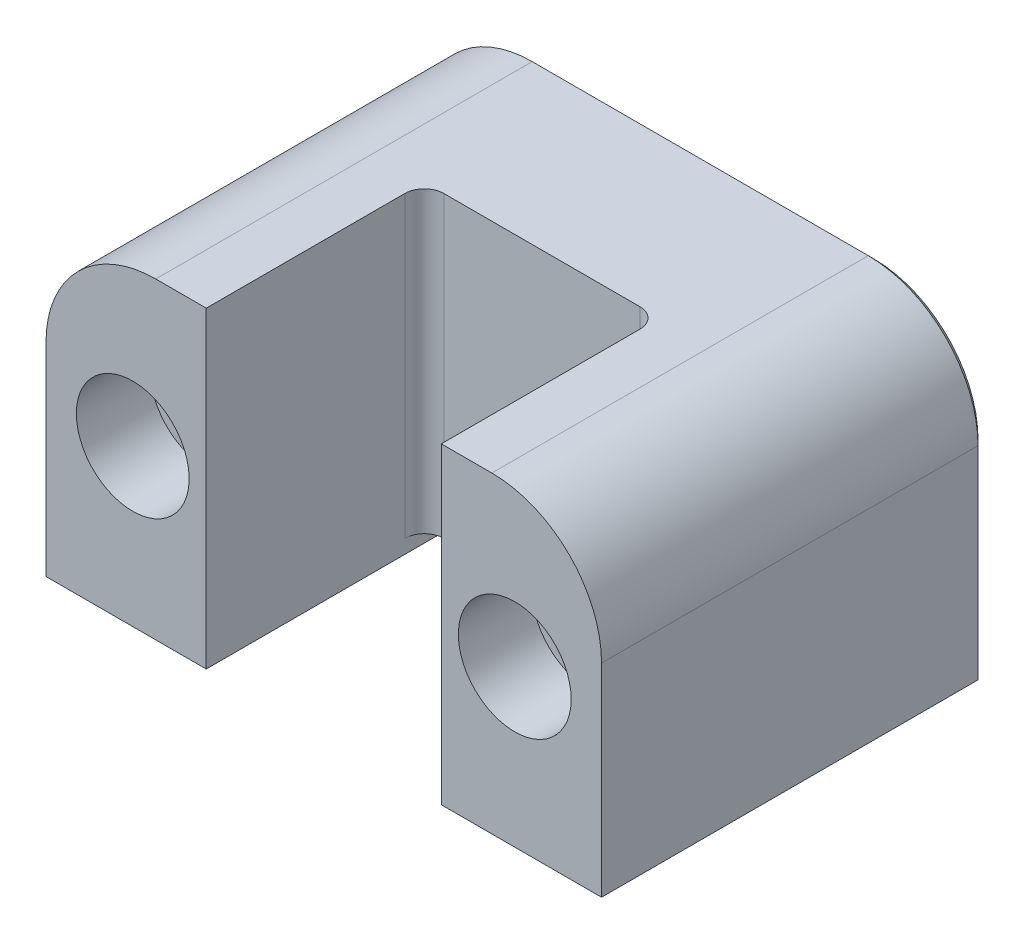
from build123d import *

# Parameters (mm, degrees)
EXTRUDE1_DEPTH     = 28.575
SKETCH3_W          = 21.4884
SKETCH3_H          = 11.770125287
CUT_EXTRUDE2_DEPTH = 1.27
FILLET3_R          = 2.032
FILLET4_R          = 1.778
FILLET5_R          = 10.033
CHAMFER1_SIZE      = 0.508


with BuildPart() as part:
    # Sketch1 → Extrude1 (new body)
    with BuildSketch(Plane(origin=(0, 0, 0), x_dir=(1, 0, 0), z_dir=(0, 1, 0))):
        Polygon((-25.39365, 0), (-10.7442, 0), (-10.7442, 19.939), (10.7442, 19.939), (10.7442, 0), (25.39365, 0), (25.39365, 34.925), (-25.39365, 34.925), align=None)
    extrude(amount=EXTRUDE1_DEPTH)

    # Sketch3 → Cut-Extrude2 (cut)
    with BuildSketch(Plane.XZ):
        with Locations((0, -20.657937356)):
            Rectangle(SKETCH3_W, SKETCH3_H)
    extrude(amount=-CUT_EXTRUDE2_DEPTH, mode=Mode.SUBTRACT)

    # Fillet3
    fillet3_edges = [part.edges().sort_by_distance(p)[0] for p in [
        (-10.7442, 0.635, -26.543),
        (10.7442, 0.635, -26.543),
    ]]
    fillet(fillet3_edges, radius=FILLET3_R)

    # Fillet4
    fillet4_edges = [part.edges().sort_by_distance(p)[0] for p in [
        (10.7442, 14.9225, -19.939),
        (-10.7442, 14.9225, -19.939),
    ]]
    fillet(fillet4_edges, radius=FILLET4_R)

    # Sketch4 → Cut-Revolve9 (revolve, cut)
    with BuildSketch(Plane(origin=(0, 14.2875, 0), x_dir=(-1, 0, 0), z_dir=(0, 1, 0)), mode=Mode.PRIVATE) as cut_revolve9_sk:
        Polygon((17.4625, -34.925), (17.4625, 0), (12.3063, 0), (12.3063, -6.7564), (13.8938, -6.7564), (13.8938, -34.925), align=None)
    cut_revolve9 = revolve(cut_revolve9_sk.sketch.rotate(Axis((-17.4625, 14.2875, -4.7498), (0, 0, 1)), 180), axis=Axis((-17.4625, 14.2875, -4.7498), (0, 0, 1)), mode=Mode.SUBTRACT)

    # Mirror1: Cut-Revolve9 across plane
    add(cut_revolve9.mirror(Plane(origin=(0, 0, 0), x_dir=(0, 0, 1), z_dir=(1, 0, 0))), mode=Mode.SUBTRACT)

    # Fillet5
    fillet5_edges = [part.edges().sort_by_distance(p)[0] for p in [
        (25.39365, 28.575, -17.4625),
        (-25.39365, 28.575, -17.4625),
    ]]
    fillet(fillet5_edges, radius=FILLET5_R)

    # Chamfer1
    chamfer1_edges = [part.edges().sort_by_distance(p)[0] for p in [
        (0, 28.575, -34.925),
        (-25.39365, 9.271, -34.925),
        (25.39365, 9.271, -34.925),
        (-22.455052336, 25.636402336, -34.925),
        (22.455052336, 25.636402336, -34.925),
    ]]
    chamfer(chamfer1_edges, length=CHAMFER1_SIZE)


solid = part.part
